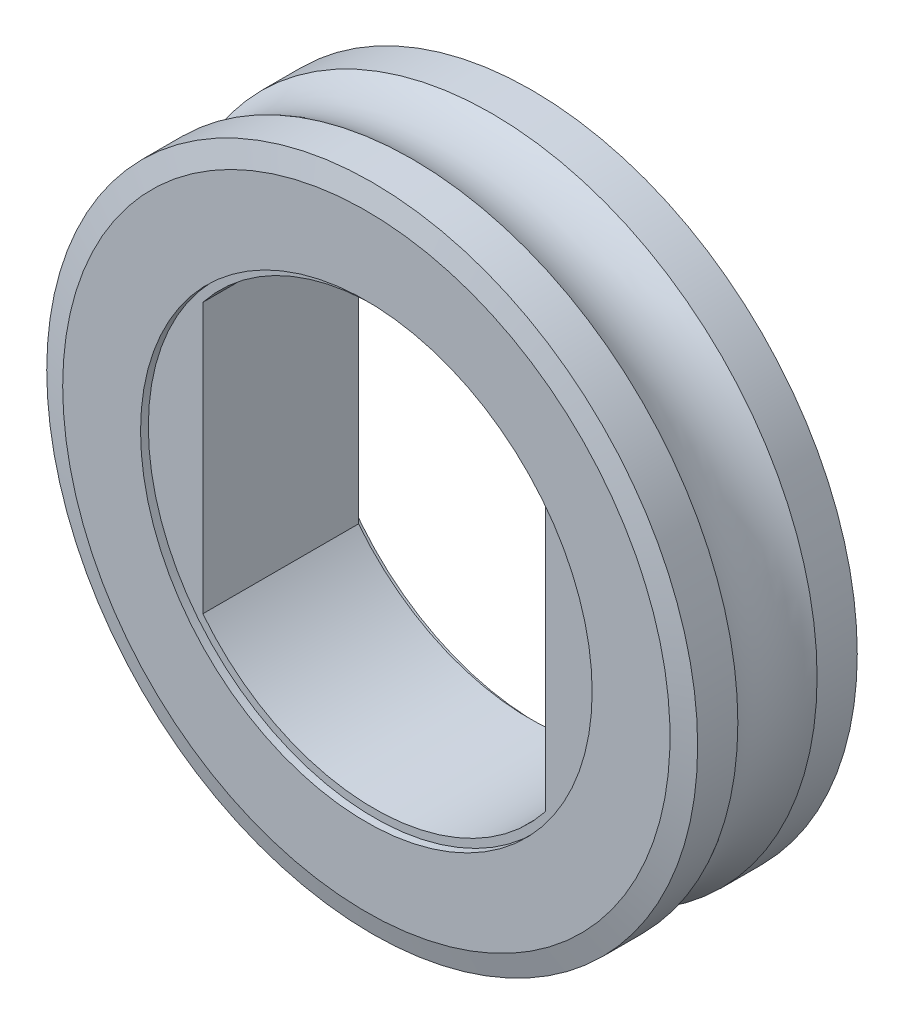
ISO-10303-21;
HEADER;
FILE_DESCRIPTION(('STEP AP214'),'2;1');
FILE_NAME('part.step','',(''),(''),'','','');
FILE_SCHEMA(('AUTOMOTIVE_DESIGN { 1 0 10303 214 1 1 1 1 }'));
ENDSEC;
DATA;
#1=APPLICATION_CONTEXT('core data for automotive mechanical design processes');
#2=APPLICATION_PROTOCOL_DEFINITION('international standard','automotive_design',2000,#1);
#3=PRODUCT_CONTEXT('',#1,'mechanical');
#4=PRODUCT('Part','Part','',(#3));
#5=PRODUCT_RELATED_PRODUCT_CATEGORY('part','',(#4));
#6=PRODUCT_DEFINITION_FORMATION('','',#4);
#7=PRODUCT_DEFINITION_CONTEXT('part definition',#1,'design');
#8=PRODUCT_DEFINITION('design','',#6,#7);
#9=PRODUCT_DEFINITION_SHAPE('','',#8);
#10=(LENGTH_UNIT() NAMED_UNIT(*) SI_UNIT(.MILLI.,.METRE.));
#11=(NAMED_UNIT(*) PLANE_ANGLE_UNIT() SI_UNIT($,.RADIAN.));
#12=(NAMED_UNIT(*) SI_UNIT($,.STERADIAN.) SOLID_ANGLE_UNIT());
#13=UNCERTAINTY_MEASURE_WITH_UNIT(LENGTH_MEASURE(1.E-05),#10,'distance_accuracy_value','');
#14=(GEOMETRIC_REPRESENTATION_CONTEXT(3) GLOBAL_UNCERTAINTY_ASSIGNED_CONTEXT((#13)) GLOBAL_UNIT_ASSIGNED_CONTEXT((#10,
#11,#12)) REPRESENTATION_CONTEXT('',''));
#15=CARTESIAN_POINT('',(0.,0.,0.));
#16=DIRECTION('',(0.,0.,1.));
#17=DIRECTION('',(1.,0.,0.));
#18=AXIS2_PLACEMENT_3D('',#15,#16,#17);
#19=CARTESIAN_POINT('',(0.,0.,-37.));
#20=DIRECTION('',(0.,0.,-1.));
#21=DIRECTION('',(-1.,0.,0.));
#22=AXIS2_PLACEMENT_3D('',#19,#20,#21);
#23=CYLINDRICAL_SURFACE('',#22,14.);
#24=DIRECTION('',(0.,0.,-1.));
#25=VECTOR('',#24,1.);
#26=CARTESIAN_POINT('',(-11.,-8.66025403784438,-27.));
#27=LINE('',#26,#25);
#28=CARTESIAN_POINT('',(-11.,-8.66025403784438,-27.));
#29=VERTEX_POINT('',#28);
#30=CARTESIAN_POINT('',(-11.,-8.66025403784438,-37.));
#31=VERTEX_POINT('',#30);
#32=EDGE_CURVE('E64',#29,#31,#27,.T.);
#33=ORIENTED_EDGE('',*,*,#32,.F.);
#34=CARTESIAN_POINT('',(0.,0.,-27.));
#35=DIRECTION('',(0.,0.,-1.));
#36=DIRECTION('',(-1.,0.,0.));
#37=AXIS2_PLACEMENT_3D('',#34,#35,#36);
#38=CIRCLE('',#37,14.);
#39=CARTESIAN_POINT('',(11.,-8.66025403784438,-27.));
#40=VERTEX_POINT('',#39);
#41=EDGE_CURVE('E90',#40,#29,#38,.T.);
#42=ORIENTED_EDGE('',*,*,#41,.F.);
#43=DIRECTION('',(0.,0.,1.));
#44=VECTOR('',#43,1.);
#45=CARTESIAN_POINT('',(11.,-8.66025403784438,-27.));
#46=LINE('',#45,#44);
#47=CARTESIAN_POINT('',(11.,-8.66025403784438,-37.));
#48=VERTEX_POINT('',#47);
#49=EDGE_CURVE('E57',#48,#40,#46,.T.);
#50=ORIENTED_EDGE('',*,*,#49,.F.);
#51=CARTESIAN_POINT('',(0.,0.,-37.));
#52=DIRECTION('',(0.,0.,-1.));
#53=DIRECTION('',(-1.,0.,0.));
#54=AXIS2_PLACEMENT_3D('',#51,#52,#53);
#55=CIRCLE('',#54,14.);
#56=EDGE_CURVE('E22',#48,#31,#55,.T.);
#57=ORIENTED_EDGE('',*,*,#56,.T.);
#58=EDGE_LOOP('',(#33,#42,#50,#57));
#59=FACE_BOUND('',#58,.T.);
#60=ADVANCED_FACE('F17',(#59),#23,.F.);
#61=CARTESIAN_POINT('',(-11.,-11.,-27.));
#62=DIRECTION('',(1.,0.,0.));
#63=DIRECTION('',(0.,0.,-1.));
#64=AXIS2_PLACEMENT_3D('',#61,#62,#63);
#65=PLANE('',#64);
#66=ORIENTED_EDGE('',*,*,#32,.T.);
#67=DIRECTION('',(0.,1.,0.));
#68=VECTOR('',#67,1.);
#69=CARTESIAN_POINT('',(-11.,0.,-37.));
#70=LINE('',#69,#68);
#71=CARTESIAN_POINT('',(-11.,8.66025403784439,-37.));
#72=VERTEX_POINT('',#71);
#73=EDGE_CURVE('E68',#31,#72,#70,.T.);
#74=ORIENTED_EDGE('',*,*,#73,.T.);
#75=DIRECTION('',(0.,0.,-1.));
#76=VECTOR('',#75,1.);
#77=CARTESIAN_POINT('',(-11.,8.66025403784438,-37.));
#78=LINE('',#77,#76);
#79=CARTESIAN_POINT('',(-11.,8.66025403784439,-27.));
#80=VERTEX_POINT('',#79);
#81=EDGE_CURVE('E70',#72,#80,#78,.F.);
#82=ORIENTED_EDGE('',*,*,#81,.T.);
#83=DIRECTION('',(0.,1.,0.));
#84=VECTOR('',#83,1.);
#85=CARTESIAN_POINT('',(-11.,0.,-27.));
#86=LINE('',#85,#84);
#87=EDGE_CURVE('E69',#29,#80,#86,.T.);
#88=ORIENTED_EDGE('',*,*,#87,.F.);
#89=EDGE_LOOP('',(#66,#74,#82,#88));
#90=FACE_BOUND('',#89,.T.);
#91=ADVANCED_FACE('F66',(#90),#65,.T.);
#92=CARTESIAN_POINT('',(0.,0.,-37.));
#93=DIRECTION('',(0.,0.,-1.));
#94=DIRECTION('',(-1.,0.,0.));
#95=AXIS2_PLACEMENT_3D('',#92,#93,#94);
#96=CYLINDRICAL_SURFACE('',#95,14.);
#97=ORIENTED_EDGE('',*,*,#81,.F.);
#98=CARTESIAN_POINT('',(0.,0.,-37.));
#99=DIRECTION('',(0.,0.,-1.));
#100=DIRECTION('',(-1.,0.,0.));
#101=AXIS2_PLACEMENT_3D('',#98,#99,#100);
#102=CIRCLE('',#101,14.);
#103=CARTESIAN_POINT('',(11.,8.66025403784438,-37.));
#104=VERTEX_POINT('',#103);
#105=EDGE_CURVE('E78',#72,#104,#102,.T.);
#106=ORIENTED_EDGE('',*,*,#105,.T.);
#107=DIRECTION('',(0.,0.,1.));
#108=VECTOR('',#107,1.);
#109=CARTESIAN_POINT('',(11.,8.66025403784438,-27.));
#110=LINE('',#109,#108);
#111=CARTESIAN_POINT('',(11.,8.66025403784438,-27.));
#112=VERTEX_POINT('',#111);
#113=EDGE_CURVE('E81',#112,#104,#110,.F.);
#114=ORIENTED_EDGE('',*,*,#113,.F.);
#115=CARTESIAN_POINT('',(0.,0.,-27.));
#116=DIRECTION('',(0.,0.,-1.));
#117=DIRECTION('',(-1.,0.,0.));
#118=AXIS2_PLACEMENT_3D('',#115,#116,#117);
#119=CIRCLE('',#118,14.);
#120=EDGE_CURVE('E37',#80,#112,#119,.T.);
#121=ORIENTED_EDGE('',*,*,#120,.F.);
#122=EDGE_LOOP('',(#97,#106,#114,#121));
#123=FACE_BOUND('',#122,.T.);
#124=ADVANCED_FACE('F129',(#123),#96,.F.);
#125=CARTESIAN_POINT('',(11.,-11.,-27.));
#126=DIRECTION('',(-1.,0.,0.));
#127=DIRECTION('',(0.,0.,1.));
#128=AXIS2_PLACEMENT_3D('',#125,#126,#127);
#129=PLANE('',#128);
#130=ORIENTED_EDGE('',*,*,#113,.T.);
#131=DIRECTION('',(0.,1.,0.));
#132=VECTOR('',#131,1.);
#133=CARTESIAN_POINT('',(11.,0.,-37.));
#134=LINE('',#133,#132);
#135=EDGE_CURVE('E80',#104,#48,#134,.F.);
#136=ORIENTED_EDGE('',*,*,#135,.T.);
#137=ORIENTED_EDGE('',*,*,#49,.T.);
#138=DIRECTION('',(0.,1.,0.));
#139=VECTOR('',#138,1.);
#140=CARTESIAN_POINT('',(11.,0.,-27.));
#141=LINE('',#140,#139);
#142=EDGE_CURVE('E86',#112,#40,#141,.F.);
#143=ORIENTED_EDGE('',*,*,#142,.F.);
#144=EDGE_LOOP('',(#130,#136,#137,#143));
#145=FACE_BOUND('',#144,.T.);
#146=ADVANCED_FACE('F131',(#145),#129,.T.);
#147=CARTESIAN_POINT('',(0.,0.,-37.));
#148=DIRECTION('',(0.,0.,1.));
#149=DIRECTION('',(1.,0.,0.));
#150=AXIS2_PLACEMENT_3D('',#147,#148,#149);
#151=PLANE('',#150);
#152=CARTESIAN_POINT('',(0.,0.,-37.));
#153=DIRECTION('',(0.,0.,1.));
#154=DIRECTION('',(1.,0.,0.));
#155=AXIS2_PLACEMENT_3D('',#152,#153,#154);
#156=CIRCLE('',#155,14.5);
#157=CARTESIAN_POINT('',(14.5,0.,-37.));
#158=VERTEX_POINT('',#157);
#159=EDGE_CURVE('E88',#158,#158,#156,.F.);
#160=ORIENTED_EDGE('',*,*,#159,.T.);
#161=EDGE_LOOP('',(#160));
#162=FACE_BOUND('',#161,.T.);
#163=ORIENTED_EDGE('',*,*,#73,.F.);
#164=ORIENTED_EDGE('',*,*,#56,.F.);
#165=ORIENTED_EDGE('',*,*,#135,.F.);
#166=ORIENTED_EDGE('',*,*,#105,.F.);
#167=EDGE_LOOP('',(#163,#164,#165,#166));
#168=FACE_BOUND('',#167,.T.);
#169=ADVANCED_FACE('F74',(#162,#168),#151,.F.);
#170=CARTESIAN_POINT('',(0.,0.,-27.));
#171=DIRECTION('',(0.,0.,1.));
#172=DIRECTION('',(1.,0.,0.));
#173=AXIS2_PLACEMENT_3D('',#170,#171,#172);
#174=PLANE('',#173);
#175=CARTESIAN_POINT('',(0.,0.,-27.));
#176=DIRECTION('',(0.,0.,1.));
#177=DIRECTION('',(1.,0.,0.));
#178=AXIS2_PLACEMENT_3D('',#175,#176,#177);
#179=CIRCLE('',#178,14.5);
#180=CARTESIAN_POINT('',(14.5,0.,-27.));
#181=VERTEX_POINT('',#180);
#182=EDGE_CURVE('E122',#181,#181,#179,.T.);
#183=ORIENTED_EDGE('',*,*,#182,.T.);
#184=EDGE_LOOP('',(#183));
#185=FACE_BOUND('',#184,.T.);
#186=ORIENTED_EDGE('',*,*,#120,.T.);
#187=ORIENTED_EDGE('',*,*,#142,.T.);
#188=ORIENTED_EDGE('',*,*,#41,.T.);
#189=ORIENTED_EDGE('',*,*,#87,.T.);
#190=EDGE_LOOP('',(#186,#187,#188,#189));
#191=FACE_BOUND('',#190,.T.);
#192=ADVANCED_FACE('F132',(#185,#191),#174,.T.);
#193=CARTESIAN_POINT('',(0.,0.,2.49999999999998));
#194=DIRECTION('',(0.,0.,1.));
#195=DIRECTION('',(1.,0.,0.));
#196=AXIS2_PLACEMENT_3D('',#193,#194,#195);
#197=CYLINDRICAL_SURFACE('',#196,14.5);
#198=CARTESIAN_POINT('',(0.,0.,-37.5));
#199=DIRECTION('',(0.,0.,1.));
#200=DIRECTION('',(1.,0.,0.));
#201=AXIS2_PLACEMENT_3D('',#198,#199,#200);
#202=CIRCLE('',#201,14.5);
#203=CARTESIAN_POINT('',(14.5,0.,-37.5));
#204=VERTEX_POINT('',#203);
#205=EDGE_CURVE('E119',#204,#204,#202,.F.);
#206=ORIENTED_EDGE('',*,*,#205,.T.);
#207=EDGE_LOOP('',(#206));
#208=FACE_BOUND('',#207,.T.);
#209=ORIENTED_EDGE('',*,*,#159,.F.);
#210=EDGE_LOOP('',(#209));
#211=FACE_BOUND('',#210,.T.);
#212=ADVANCED_FACE('F134',(#208,#211),#197,.F.);
#213=CARTESIAN_POINT('',(0.,0.,2.49999999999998));
#214=DIRECTION('',(0.,0.,1.));
#215=DIRECTION('',(1.,0.,0.));
#216=AXIS2_PLACEMENT_3D('',#213,#214,#215);
#217=CYLINDRICAL_SURFACE('',#216,14.5);
#218=ORIENTED_EDGE('',*,*,#182,.F.);
#219=EDGE_LOOP('',(#218));
#220=FACE_BOUND('',#219,.T.);
#221=CARTESIAN_POINT('',(0.,0.,-26.5));
#222=DIRECTION('',(0.,0.,1.));
#223=DIRECTION('',(1.,0.,0.));
#224=AXIS2_PLACEMENT_3D('',#221,#222,#223);
#225=CIRCLE('',#224,14.5);
#226=CARTESIAN_POINT('',(14.5,0.,-26.5));
#227=VERTEX_POINT('',#226);
#228=EDGE_CURVE('E116',#227,#227,#225,.F.);
#229=ORIENTED_EDGE('',*,*,#228,.F.);
#230=EDGE_LOOP('',(#229));
#231=FACE_BOUND('',#230,.T.);
#232=ADVANCED_FACE('F142',(#220,#231),#217,.F.);
#233=CARTESIAN_POINT('',(0.,0.,-37.5));
#234=DIRECTION('',(0.,0.,1.));
#235=DIRECTION('',(1.,0.,0.));
#236=AXIS2_PLACEMENT_3D('',#233,#234,#235);
#237=PLANE('',#236);
#238=ORIENTED_EDGE('',*,*,#205,.F.);
#239=EDGE_LOOP('',(#238));
#240=FACE_BOUND('',#239,.T.);
#241=CARTESIAN_POINT('',(0.,0.,-37.5));
#242=DIRECTION('',(0.,0.,1.));
#243=DIRECTION('',(1.,0.,0.));
#244=AXIS2_PLACEMENT_3D('',#241,#242,#243);
#245=CIRCLE('',#244,19.5);
#246=CARTESIAN_POINT('',(19.5,0.,-37.5));
#247=VERTEX_POINT('',#246);
#248=EDGE_CURVE('E113',#247,#247,#245,.T.);
#249=ORIENTED_EDGE('',*,*,#248,.F.);
#250=EDGE_LOOP('',(#249));
#251=FACE_BOUND('',#250,.T.);
#252=ADVANCED_FACE('F176',(#240,#251),#237,.F.);
#253=CARTESIAN_POINT('',(0.,0.,-26.5));
#254=DIRECTION('',(0.,0.,1.));
#255=DIRECTION('',(1.,0.,0.));
#256=AXIS2_PLACEMENT_3D('',#253,#254,#255);
#257=PLANE('',#256);
#258=ORIENTED_EDGE('',*,*,#228,.T.);
#259=EDGE_LOOP('',(#258));
#260=FACE_BOUND('',#259,.T.);
#261=CARTESIAN_POINT('',(0.,0.,-26.5));
#262=DIRECTION('',(0.,0.,-1.));
#263=DIRECTION('',(-1.,0.,0.));
#264=AXIS2_PLACEMENT_3D('',#261,#262,#263);
#265=CIRCLE('',#264,19.5);
#266=CARTESIAN_POINT('',(-19.5,0.,-26.5));
#267=VERTEX_POINT('',#266);
#268=EDGE_CURVE('E95',#267,#267,#265,.T.);
#269=ORIENTED_EDGE('',*,*,#268,.F.);
#270=EDGE_LOOP('',(#269));
#271=FACE_BOUND('',#270,.T.);
#272=ADVANCED_FACE('F172',(#260,#271),#257,.T.);
#273=CARTESIAN_POINT('',(0.,0.,-37.1248711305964));
#274=DIRECTION('',(0.,0.,1.));
#275=DIRECTION('',(1.,0.,0.));
#276=AXIS2_PLACEMENT_3D('',#273,#274,#275);
#277=CONICAL_SURFACE('',#276,20.9,1.30899693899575);
#278=CARTESIAN_POINT('',(0.,0.,-37.1248711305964));
#279=DIRECTION('',(0.,0.,-1.));
#280=DIRECTION('',(-1.,0.,0.));
#281=AXIS2_PLACEMENT_3D('',#278,#279,#280);
#282=CIRCLE('',#281,20.9);
#283=CARTESIAN_POINT('',(-20.9,0.,-37.1248711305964));
#284=VERTEX_POINT('',#283);
#285=EDGE_CURVE('E91',#284,#284,#282,.F.);
#286=ORIENTED_EDGE('',*,*,#285,.F.);
#287=EDGE_LOOP('',(#286));
#288=FACE_BOUND('',#287,.T.);
#289=ORIENTED_EDGE('',*,*,#248,.T.);
#290=EDGE_LOOP('',(#289));
#291=FACE_BOUND('',#290,.T.);
#292=ADVANCED_FACE('F166',(#288,#291),#277,.T.);
#293=CARTESIAN_POINT('',(0.,0.,-26.8751288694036));
#294=DIRECTION('',(0.,0.,-1.));
#295=DIRECTION('',(-1.,0.,0.));
#296=AXIS2_PLACEMENT_3D('',#293,#294,#295);
#297=CONICAL_SURFACE('',#296,20.9,1.30899693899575);
#298=ORIENTED_EDGE('',*,*,#268,.T.);
#299=EDGE_LOOP('',(#298));
#300=FACE_BOUND('',#299,.T.);
#301=CARTESIAN_POINT('',(0.,0.,-26.8751288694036));
#302=DIRECTION('',(0.,0.,-1.));
#303=DIRECTION('',(-1.,0.,0.));
#304=AXIS2_PLACEMENT_3D('',#301,#302,#303);
#305=CIRCLE('',#304,20.9);
#306=CARTESIAN_POINT('',(-20.9,0.,-26.8751288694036));
#307=VERTEX_POINT('',#306);
#308=EDGE_CURVE('E94',#307,#307,#305,.T.);
#309=ORIENTED_EDGE('',*,*,#308,.F.);
#310=EDGE_LOOP('',(#309));
#311=FACE_BOUND('',#310,.T.);
#312=ADVANCED_FACE('F160',(#300,#311),#297,.T.);
#313=CARTESIAN_POINT('',(0.,0.,-37.5));
#314=DIRECTION('',(0.,0.,-1.));
#315=DIRECTION('',(-1.,0.,0.));
#316=AXIS2_PLACEMENT_3D('',#313,#314,#315);
#317=CYLINDRICAL_SURFACE('',#316,20.9);
#318=ORIENTED_EDGE('',*,*,#285,.T.);
#319=EDGE_LOOP('',(#318));
#320=FACE_BOUND('',#319,.T.);
#321=CARTESIAN_POINT('',(0.,0.,-34.5444694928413));
#322=DIRECTION('',(0.,0.,-1.));
#323=DIRECTION('',(-1.,0.,0.));
#324=AXIS2_PLACEMENT_3D('',#321,#322,#323);
#325=CIRCLE('',#324,20.9);
#326=CARTESIAN_POINT('',(-20.9,0.,-34.5444694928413));
#327=VERTEX_POINT('',#326);
#328=EDGE_CURVE('E28',#327,#327,#325,.T.);
#329=ORIENTED_EDGE('',*,*,#328,.T.);
#330=EDGE_LOOP('',(#329));
#331=FACE_BOUND('',#330,.T.);
#332=ADVANCED_FACE('F153',(#320,#331),#317,.T.);
#333=CARTESIAN_POINT('',(0.,0.,-37.5));
#334=DIRECTION('',(0.,0.,-1.));
#335=DIRECTION('',(-1.,0.,0.));
#336=AXIS2_PLACEMENT_3D('',#333,#334,#335);
#337=CYLINDRICAL_SURFACE('',#336,20.9);
#338=ORIENTED_EDGE('',*,*,#308,.T.);
#339=EDGE_LOOP('',(#338));
#340=FACE_BOUND('',#339,.T.);
#341=CARTESIAN_POINT('',(0.,0.,-29.4555305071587));
#342=DIRECTION('',(0.,0.,-1.));
#343=DIRECTION('',(-1.,0.,0.));
#344=AXIS2_PLACEMENT_3D('',#341,#342,#343);
#345=CIRCLE('',#344,20.9);
#346=CARTESIAN_POINT('',(-20.9,0.,-29.4555305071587));
#347=VERTEX_POINT('',#346);
#348=EDGE_CURVE('E11',#347,#347,#345,.F.);
#349=ORIENTED_EDGE('',*,*,#348,.T.);
#350=EDGE_LOOP('',(#349));
#351=FACE_BOUND('',#350,.T.);
#352=ADVANCED_FACE('F148',(#340,#351),#337,.T.);
#353=CARTESIAN_POINT('',(0.,0.,-32.));
#354=DIRECTION('',(0.,0.,-1.));
#355=DIRECTION('',(-1.,0.,0.));
#356=AXIS2_PLACEMENT_3D('',#353,#354,#355);
#357=TOROIDAL_SURFACE('',#356,25.07,4.885);
#358=ORIENTED_EDGE('',*,*,#348,.F.);
#359=EDGE_LOOP('',(#358));
#360=FACE_BOUND('',#359,.T.);
#361=ORIENTED_EDGE('',*,*,#328,.F.);
#362=EDGE_LOOP('',(#361));
#363=FACE_BOUND('',#362,.T.);
#364=ADVANCED_FACE('F19',(#360,#363),#357,.F.);
#365=CLOSED_SHELL('',(#60,#91,#124,#146,#169,#192,#212,#232,#252,#272,#292,#312,#332,#352,#364));
#366=MANIFOLD_SOLID_BREP('B1',#365);
#367=ADVANCED_BREP_SHAPE_REPRESENTATION('',(#18,#366),#14);
#368=SHAPE_DEFINITION_REPRESENTATION(#9,#367);
ENDSEC;
END-ISO-10303-21;
